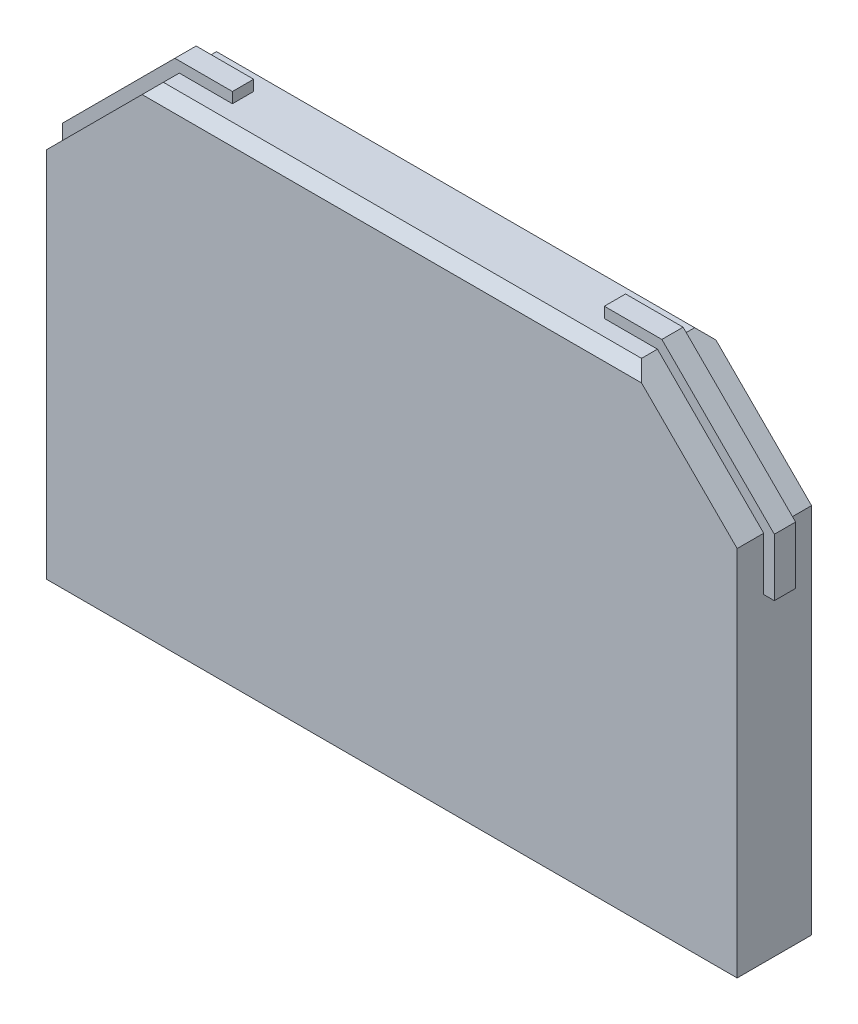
ISO-10303-21;
HEADER;
FILE_DESCRIPTION(('STEP AP214'),'2;1');
FILE_NAME('part.step','',(''),(''),'','','');
FILE_SCHEMA(('AUTOMOTIVE_DESIGN { 1 0 10303 214 1 1 1 1 }'));
ENDSEC;
DATA;
#1=APPLICATION_CONTEXT('core data for automotive mechanical design processes');
#2=APPLICATION_PROTOCOL_DEFINITION('international standard','automotive_design',2000,#1);
#3=PRODUCT_CONTEXT('',#1,'mechanical');
#4=PRODUCT('Part','Part','',(#3));
#5=PRODUCT_RELATED_PRODUCT_CATEGORY('part','',(#4));
#6=PRODUCT_DEFINITION_FORMATION('','',#4);
#7=PRODUCT_DEFINITION_CONTEXT('part definition',#1,'design');
#8=PRODUCT_DEFINITION('design','',#6,#7);
#9=PRODUCT_DEFINITION_SHAPE('','',#8);
#10=(LENGTH_UNIT() NAMED_UNIT(*) SI_UNIT(.MILLI.,.METRE.));
#11=(NAMED_UNIT(*) PLANE_ANGLE_UNIT() SI_UNIT($,.RADIAN.));
#12=(NAMED_UNIT(*) SI_UNIT($,.STERADIAN.) SOLID_ANGLE_UNIT());
#13=UNCERTAINTY_MEASURE_WITH_UNIT(LENGTH_MEASURE(1.E-05),#10,'distance_accuracy_value','');
#14=(GEOMETRIC_REPRESENTATION_CONTEXT(3) GLOBAL_UNCERTAINTY_ASSIGNED_CONTEXT((#13)) GLOBAL_UNIT_ASSIGNED_CONTEXT((#10,
#11,#12)) REPRESENTATION_CONTEXT('',''));
#15=CARTESIAN_POINT('',(0.,0.,0.));
#16=DIRECTION('',(0.,0.,1.));
#17=DIRECTION('',(1.,0.,0.));
#18=AXIS2_PLACEMENT_3D('',#15,#16,#17);
#19=CARTESIAN_POINT('',(-2.25,6.5,0.));
#20=DIRECTION('',(0.707106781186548,-0.707106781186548,0.));
#21=DIRECTION('',(0.,0.,1.));
#22=AXIS2_PLACEMENT_3D('',#19,#20,#21);
#23=PLANE('',#22);
#24=DIRECTION('',(0.,0.,-1.));
#25=VECTOR('',#24,1.);
#26=CARTESIAN_POINT('',(-3.25,5.5,0.35));
#27=LINE('',#26,#25);
#28=CARTESIAN_POINT('',(-3.25,5.5,-0.1));
#29=VERTEX_POINT('',#28);
#30=CARTESIAN_POINT('',(-3.25,5.5,-0.35));
#31=VERTEX_POINT('',#30);
#32=EDGE_CURVE('E11',#29,#31,#27,.T.);
#33=ORIENTED_EDGE('',*,*,#32,.F.);
#34=DIRECTION('',(-0.707106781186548,-0.707106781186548,0.));
#35=VECTOR('',#34,1.);
#36=CARTESIAN_POINT('',(-2.25,6.5,-0.1));
#37=LINE('',#36,#35);
#38=CARTESIAN_POINT('',(-2.25,6.5,-0.1));
#39=VERTEX_POINT('',#38);
#40=EDGE_CURVE('E25',#39,#29,#37,.T.);
#41=ORIENTED_EDGE('',*,*,#40,.F.);
#42=DIRECTION('',(0.,0.,1.));
#43=VECTOR('',#42,1.);
#44=CARTESIAN_POINT('',(-2.25,6.5,0.));
#45=LINE('',#44,#43);
#46=CARTESIAN_POINT('',(-2.25,6.5,-0.25));
#47=VERTEX_POINT('',#46);
#48=EDGE_CURVE('E460',#47,#39,#45,.T.);
#49=ORIENTED_EDGE('',*,*,#48,.F.);
#50=DIRECTION('',(-0.577350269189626,-0.577350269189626,-0.577350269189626));
#51=VECTOR('',#50,1.);
#52=CARTESIAN_POINT('',(-2.166666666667,6.583333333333,-0.166666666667));
#53=LINE('',#52,#51);
#54=CARTESIAN_POINT('',(-2.35,6.4,-0.35));
#55=VERTEX_POINT('',#54);
#56=EDGE_CURVE('E456',#47,#55,#53,.T.);
#57=ORIENTED_EDGE('',*,*,#56,.T.);
#58=DIRECTION('',(0.707106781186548,0.707106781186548,0.));
#59=VECTOR('',#58,1.);
#60=CARTESIAN_POINT('',(-2.25,6.5,-0.35));
#61=LINE('',#60,#59);
#62=EDGE_CURVE('E451',#31,#55,#61,.T.);
#63=ORIENTED_EDGE('',*,*,#62,.F.);
#64=EDGE_LOOP('',(#33,#41,#49,#57,#63));
#65=FACE_BOUND('',#64,.T.);
#66=ADVANCED_FACE('F17',(#65),#23,.F.);
#67=CARTESIAN_POINT('',(-3.25,6.5,-0.35));
#68=DIRECTION('',(0.,0.,1.));
#69=DIRECTION('',(1.,0.,0.));
#70=AXIS2_PLACEMENT_3D('',#67,#68,#69);
#71=PLANE('',#70);
#72=ORIENTED_EDGE('',*,*,#62,.T.);
#73=DIRECTION('',(1.,0.,0.));
#74=VECTOR('',#73,1.);
#75=CARTESIAN_POINT('',(-3.25,6.4,-0.35));
#76=LINE('',#75,#74);
#77=CARTESIAN_POINT('',(2.35,6.4,-0.35));
#78=VERTEX_POINT('',#77);
#79=EDGE_CURVE('E447',#55,#78,#76,.T.);
#80=ORIENTED_EDGE('',*,*,#79,.T.);
#81=DIRECTION('',(0.707106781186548,-0.707106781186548,0.));
#82=VECTOR('',#81,1.);
#83=CARTESIAN_POINT('',(2.25,6.5,-0.35));
#84=LINE('',#83,#82);
#85=CARTESIAN_POINT('',(3.25,5.5,-0.35));
#86=VERTEX_POINT('',#85);
#87=EDGE_CURVE('E443',#78,#86,#84,.T.);
#88=ORIENTED_EDGE('',*,*,#87,.T.);
#89=DIRECTION('',(0.,-1.,0.));
#90=VECTOR('',#89,1.);
#91=CARTESIAN_POINT('',(3.25,6.5,-0.35));
#92=LINE('',#91,#90);
#93=CARTESIAN_POINT('',(3.25,2.,-0.35));
#94=VERTEX_POINT('',#93);
#95=EDGE_CURVE('E439',#86,#94,#92,.T.);
#96=ORIENTED_EDGE('',*,*,#95,.T.);
#97=DIRECTION('',(-1.,0.,0.));
#98=VECTOR('',#97,1.);
#99=CARTESIAN_POINT('',(-3.25,2.,-0.35));
#100=LINE('',#99,#98);
#101=CARTESIAN_POINT('',(-3.25,2.,-0.35));
#102=VERTEX_POINT('',#101);
#103=EDGE_CURVE('E435',#94,#102,#100,.T.);
#104=ORIENTED_EDGE('',*,*,#103,.T.);
#105=DIRECTION('',(0.,-1.,0.));
#106=VECTOR('',#105,1.);
#107=CARTESIAN_POINT('',(-3.25,6.5,-0.35));
#108=LINE('',#107,#106);
#109=EDGE_CURVE('E430',#31,#102,#108,.T.);
#110=ORIENTED_EDGE('',*,*,#109,.F.);
#111=EDGE_LOOP('',(#72,#80,#88,#96,#104,#110));
#112=FACE_BOUND('',#111,.T.);
#113=ADVANCED_FACE('F486',(#112),#71,.F.);
#114=CARTESIAN_POINT('',(-3.25,6.5,0.35));
#115=DIRECTION('',(1.,0.,0.));
#116=DIRECTION('',(0.,0.,-1.));
#117=AXIS2_PLACEMENT_3D('',#114,#115,#116);
#118=PLANE('',#117);
#119=DIRECTION('',(0.,0.,-1.));
#120=VECTOR('',#119,1.);
#121=CARTESIAN_POINT('',(-3.25,5.5,0.35));
#122=LINE('',#121,#120);
#123=CARTESIAN_POINT('',(-3.25,5.5,0.35));
#124=VERTEX_POINT('',#123);
#125=CARTESIAN_POINT('',(-3.25,5.5,0.1));
#126=VERTEX_POINT('',#125);
#127=EDGE_CURVE('E426',#124,#126,#122,.T.);
#128=ORIENTED_EDGE('',*,*,#127,.T.);
#129=DIRECTION('',(0.,-1.,0.));
#130=VECTOR('',#129,1.);
#131=CARTESIAN_POINT('',(-3.25,5.5,0.1));
#132=LINE('',#131,#130);
#133=CARTESIAN_POINT('',(-3.25,5.,0.1));
#134=VERTEX_POINT('',#133);
#135=EDGE_CURVE('E422',#126,#134,#132,.T.);
#136=ORIENTED_EDGE('',*,*,#135,.T.);
#137=DIRECTION('',(0.,0.,-1.));
#138=VECTOR('',#137,1.);
#139=CARTESIAN_POINT('',(-3.25,5.,0.1));
#140=LINE('',#139,#138);
#141=CARTESIAN_POINT('',(-3.25,5.,-0.1));
#142=VERTEX_POINT('',#141);
#143=EDGE_CURVE('E418',#134,#142,#140,.T.);
#144=ORIENTED_EDGE('',*,*,#143,.T.);
#145=DIRECTION('',(0.,-1.,0.));
#146=VECTOR('',#145,1.);
#147=CARTESIAN_POINT('',(-3.25,5.5,-0.1));
#148=LINE('',#147,#146);
#149=EDGE_CURVE('E413',#29,#142,#148,.T.);
#150=ORIENTED_EDGE('',*,*,#149,.F.);
#151=ORIENTED_EDGE('',*,*,#32,.T.);
#152=ORIENTED_EDGE('',*,*,#109,.T.);
#153=DIRECTION('',(0.,0.,1.));
#154=VECTOR('',#153,1.);
#155=CARTESIAN_POINT('',(-3.25,2.,0.35));
#156=LINE('',#155,#154);
#157=CARTESIAN_POINT('',(-3.25,2.,0.35));
#158=VERTEX_POINT('',#157);
#159=EDGE_CURVE('E409',#102,#158,#156,.T.);
#160=ORIENTED_EDGE('',*,*,#159,.T.);
#161=DIRECTION('',(0.,-1.,0.));
#162=VECTOR('',#161,1.);
#163=CARTESIAN_POINT('',(-3.25,6.5,0.35));
#164=LINE('',#163,#162);
#165=EDGE_CURVE('E404',#124,#158,#164,.T.);
#166=ORIENTED_EDGE('',*,*,#165,.F.);
#167=EDGE_LOOP('',(#128,#136,#144,#150,#151,#152,#160,#166));
#168=FACE_BOUND('',#167,.T.);
#169=ADVANCED_FACE('F490',(#168),#118,.F.);
#170=CARTESIAN_POINT('',(-3.25,6.5,0.35));
#171=DIRECTION('',(0.,0.,-1.));
#172=DIRECTION('',(-1.,0.,0.));
#173=AXIS2_PLACEMENT_3D('',#170,#171,#172);
#174=PLANE('',#173);
#175=DIRECTION('',(-0.707106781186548,0.707106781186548,0.));
#176=VECTOR('',#175,1.);
#177=CARTESIAN_POINT('',(2.25,6.5,0.35));
#178=LINE('',#177,#176);
#179=CARTESIAN_POINT('',(3.25,5.5,0.35));
#180=VERTEX_POINT('',#179);
#181=CARTESIAN_POINT('',(2.35,6.4,0.35));
#182=VERTEX_POINT('',#181);
#183=EDGE_CURVE('E400',#180,#182,#178,.T.);
#184=ORIENTED_EDGE('',*,*,#183,.T.);
#185=DIRECTION('',(-1.,0.,0.));
#186=VECTOR('',#185,1.);
#187=CARTESIAN_POINT('',(-3.25,6.4,0.35));
#188=LINE('',#187,#186);
#189=CARTESIAN_POINT('',(-2.35,6.4,0.35));
#190=VERTEX_POINT('',#189);
#191=EDGE_CURVE('E396',#182,#190,#188,.T.);
#192=ORIENTED_EDGE('',*,*,#191,.T.);
#193=DIRECTION('',(-0.707106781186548,-0.707106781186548,0.));
#194=VECTOR('',#193,1.);
#195=CARTESIAN_POINT('',(-2.25,6.5,0.35));
#196=LINE('',#195,#194);
#197=EDGE_CURVE('E391',#190,#124,#196,.T.);
#198=ORIENTED_EDGE('',*,*,#197,.T.);
#199=ORIENTED_EDGE('',*,*,#165,.T.);
#200=DIRECTION('',(1.,0.,0.));
#201=VECTOR('',#200,1.);
#202=CARTESIAN_POINT('',(-3.25,2.,0.35));
#203=LINE('',#202,#201);
#204=CARTESIAN_POINT('',(3.25,2.,0.35));
#205=VERTEX_POINT('',#204);
#206=EDGE_CURVE('E387',#158,#205,#203,.T.);
#207=ORIENTED_EDGE('',*,*,#206,.T.);
#208=DIRECTION('',(0.,-1.,0.));
#209=VECTOR('',#208,1.);
#210=CARTESIAN_POINT('',(3.25,6.5,0.35));
#211=LINE('',#210,#209);
#212=EDGE_CURVE('E382',#180,#205,#211,.T.);
#213=ORIENTED_EDGE('',*,*,#212,.F.);
#214=EDGE_LOOP('',(#184,#192,#198,#199,#207,#213));
#215=FACE_BOUND('',#214,.T.);
#216=ADVANCED_FACE('F590',(#215),#174,.F.);
#217=CARTESIAN_POINT('',(3.25,6.5,0.35));
#218=DIRECTION('',(-1.,0.,0.));
#219=DIRECTION('',(0.,0.,1.));
#220=AXIS2_PLACEMENT_3D('',#217,#218,#219);
#221=PLANE('',#220);
#222=DIRECTION('',(0.,0.,-1.));
#223=VECTOR('',#222,1.);
#224=CARTESIAN_POINT('',(3.25,5.,0.1));
#225=LINE('',#224,#223);
#226=CARTESIAN_POINT('',(3.25,5.,0.1));
#227=VERTEX_POINT('',#226);
#228=CARTESIAN_POINT('',(3.25,5.,-0.1));
#229=VERTEX_POINT('',#228);
#230=EDGE_CURVE('E377',#227,#229,#225,.T.);
#231=ORIENTED_EDGE('',*,*,#230,.F.);
#232=DIRECTION('',(0.,-1.,0.));
#233=VECTOR('',#232,1.);
#234=CARTESIAN_POINT('',(3.25,5.5,0.1));
#235=LINE('',#234,#233);
#236=CARTESIAN_POINT('',(3.25,5.5,0.1));
#237=VERTEX_POINT('',#236);
#238=EDGE_CURVE('E372',#237,#227,#235,.T.);
#239=ORIENTED_EDGE('',*,*,#238,.F.);
#240=DIRECTION('',(0.,0.,1.));
#241=VECTOR('',#240,1.);
#242=CARTESIAN_POINT('',(3.25,5.5,0.35));
#243=LINE('',#242,#241);
#244=EDGE_CURVE('E367',#237,#180,#243,.T.);
#245=ORIENTED_EDGE('',*,*,#244,.T.);
#246=ORIENTED_EDGE('',*,*,#212,.T.);
#247=DIRECTION('',(0.,0.,-1.));
#248=VECTOR('',#247,1.);
#249=CARTESIAN_POINT('',(3.25,2.,0.35));
#250=LINE('',#249,#248);
#251=EDGE_CURVE('E362',#205,#94,#250,.T.);
#252=ORIENTED_EDGE('',*,*,#251,.T.);
#253=ORIENTED_EDGE('',*,*,#95,.F.);
#254=DIRECTION('',(0.,0.,1.));
#255=VECTOR('',#254,1.);
#256=CARTESIAN_POINT('',(3.25,5.5,0.35));
#257=LINE('',#256,#255);
#258=CARTESIAN_POINT('',(3.25,5.5,-0.1));
#259=VERTEX_POINT('',#258);
#260=EDGE_CURVE('E358',#86,#259,#257,.T.);
#261=ORIENTED_EDGE('',*,*,#260,.T.);
#262=DIRECTION('',(0.,-1.,0.));
#263=VECTOR('',#262,1.);
#264=CARTESIAN_POINT('',(3.25,5.5,-0.1));
#265=LINE('',#264,#263);
#266=EDGE_CURVE('E354',#259,#229,#265,.T.);
#267=ORIENTED_EDGE('',*,*,#266,.T.);
#268=EDGE_LOOP('',(#231,#239,#245,#246,#252,#253,#261,#267));
#269=FACE_BOUND('',#268,.T.);
#270=ADVANCED_FACE('F585',(#269),#221,.F.);
#271=CARTESIAN_POINT('',(0.,0.,-0.1));
#272=DIRECTION('',(0.,0.,1.));
#273=DIRECTION('',(1.,0.,0.));
#274=AXIS2_PLACEMENT_3D('',#271,#272,#273);
#275=PLANE('',#274);
#276=DIRECTION('',(0.,-1.,0.));
#277=VECTOR('',#276,1.);
#278=CARTESIAN_POINT('',(1.75,6.5,-0.1));
#279=LINE('',#278,#277);
#280=CARTESIAN_POINT('',(1.75,6.6,-0.1));
#281=VERTEX_POINT('',#280);
#282=CARTESIAN_POINT('',(1.75,6.5,-0.1));
#283=VERTEX_POINT('',#282);
#284=EDGE_CURVE('E350',#281,#283,#279,.T.);
#285=ORIENTED_EDGE('',*,*,#284,.F.);
#286=DIRECTION('',(-1.,0.,0.));
#287=VECTOR('',#286,1.);
#288=CARTESIAN_POINT('',(2.291421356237,6.6,-0.1));
#289=LINE('',#288,#287);
#290=CARTESIAN_POINT('',(2.291421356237,6.6,-0.1));
#291=VERTEX_POINT('',#290);
#292=EDGE_CURVE('E191',#291,#281,#289,.T.);
#293=ORIENTED_EDGE('',*,*,#292,.F.);
#294=DIRECTION('',(-0.707106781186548,0.707106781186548,0.));
#295=VECTOR('',#294,1.);
#296=CARTESIAN_POINT('',(2.291421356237,6.6,-0.1));
#297=LINE('',#296,#295);
#298=CARTESIAN_POINT('',(3.35,5.541421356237,-0.1));
#299=VERTEX_POINT('',#298);
#300=EDGE_CURVE('E342',#299,#291,#297,.T.);
#301=ORIENTED_EDGE('',*,*,#300,.F.);
#302=DIRECTION('',(0.,1.,0.));
#303=VECTOR('',#302,1.);
#304=CARTESIAN_POINT('',(3.35,5.541421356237,-0.1));
#305=LINE('',#304,#303);
#306=CARTESIAN_POINT('',(3.35,5.,-0.1));
#307=VERTEX_POINT('',#306);
#308=EDGE_CURVE('E337',#307,#299,#305,.T.);
#309=ORIENTED_EDGE('',*,*,#308,.F.);
#310=DIRECTION('',(1.,0.,0.));
#311=VECTOR('',#310,1.);
#312=CARTESIAN_POINT('',(3.25,5.,-0.1));
#313=LINE('',#312,#311);
#314=EDGE_CURVE('E332',#229,#307,#313,.T.);
#315=ORIENTED_EDGE('',*,*,#314,.F.);
#316=ORIENTED_EDGE('',*,*,#266,.F.);
#317=DIRECTION('',(0.707106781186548,-0.707106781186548,0.));
#318=VECTOR('',#317,1.);
#319=CARTESIAN_POINT('',(2.25,6.5,-0.1));
#320=LINE('',#319,#318);
#321=CARTESIAN_POINT('',(2.25,6.5,-0.1));
#322=VERTEX_POINT('',#321);
#323=EDGE_CURVE('E327',#322,#259,#320,.T.);
#324=ORIENTED_EDGE('',*,*,#323,.F.);
#325=DIRECTION('',(1.,0.,0.));
#326=VECTOR('',#325,1.);
#327=CARTESIAN_POINT('',(2.25,6.5,-0.1));
#328=LINE('',#327,#326);
#329=EDGE_CURVE('E322',#283,#322,#328,.T.);
#330=ORIENTED_EDGE('',*,*,#329,.F.);
#331=EDGE_LOOP('',(#285,#293,#301,#309,#315,#316,#324,#330));
#332=FACE_BOUND('',#331,.T.);
#333=ADVANCED_FACE('F598',(#332),#275,.F.);
#334=CARTESIAN_POINT('',(0.,6.5,0.));
#335=DIRECTION('',(0.,-1.,0.));
#336=DIRECTION('',(0.,0.,-1.));
#337=AXIS2_PLACEMENT_3D('',#334,#335,#336);
#338=PLANE('',#337);
#339=DIRECTION('',(0.,0.,-1.));
#340=VECTOR('',#339,1.);
#341=CARTESIAN_POINT('',(-1.75,6.5,0.1));
#342=LINE('',#341,#340);
#343=CARTESIAN_POINT('',(-1.75,6.5,0.1));
#344=VERTEX_POINT('',#343);
#345=CARTESIAN_POINT('',(-1.75,6.5,-0.1));
#346=VERTEX_POINT('',#345);
#347=EDGE_CURVE('E317',#344,#346,#342,.T.);
#348=ORIENTED_EDGE('',*,*,#347,.F.);
#349=DIRECTION('',(-1.,0.,0.));
#350=VECTOR('',#349,1.);
#351=CARTESIAN_POINT('',(-2.25,6.5,0.1));
#352=LINE('',#351,#350);
#353=CARTESIAN_POINT('',(-2.25,6.5,0.1));
#354=VERTEX_POINT('',#353);
#355=EDGE_CURVE('E313',#344,#354,#352,.T.);
#356=ORIENTED_EDGE('',*,*,#355,.T.);
#357=DIRECTION('',(0.,0.,1.));
#358=VECTOR('',#357,1.);
#359=CARTESIAN_POINT('',(-2.25,6.5,0.));
#360=LINE('',#359,#358);
#361=CARTESIAN_POINT('',(-2.25,6.5,0.25));
#362=VERTEX_POINT('',#361);
#363=EDGE_CURVE('E309',#354,#362,#360,.T.);
#364=ORIENTED_EDGE('',*,*,#363,.T.);
#365=DIRECTION('',(1.,0.,0.));
#366=VECTOR('',#365,1.);
#367=CARTESIAN_POINT('',(0.,6.5,0.25));
#368=LINE('',#367,#366);
#369=CARTESIAN_POINT('',(2.25,6.5,0.25));
#370=VERTEX_POINT('',#369);
#371=EDGE_CURVE('E305',#362,#370,#368,.T.);
#372=ORIENTED_EDGE('',*,*,#371,.T.);
#373=DIRECTION('',(0.,0.,-1.));
#374=VECTOR('',#373,1.);
#375=CARTESIAN_POINT('',(2.25,6.5,0.));
#376=LINE('',#375,#374);
#377=CARTESIAN_POINT('',(2.25,6.5,0.1));
#378=VERTEX_POINT('',#377);
#379=EDGE_CURVE('E301',#370,#378,#376,.T.);
#380=ORIENTED_EDGE('',*,*,#379,.T.);
#381=DIRECTION('',(1.,0.,0.));
#382=VECTOR('',#381,1.);
#383=CARTESIAN_POINT('',(2.25,6.5,0.1));
#384=LINE('',#383,#382);
#385=CARTESIAN_POINT('',(1.75,6.5,0.1));
#386=VERTEX_POINT('',#385);
#387=EDGE_CURVE('E297',#386,#378,#384,.T.);
#388=ORIENTED_EDGE('',*,*,#387,.F.);
#389=DIRECTION('',(0.,0.,-1.));
#390=VECTOR('',#389,1.);
#391=CARTESIAN_POINT('',(1.75,6.5,0.1));
#392=LINE('',#391,#390);
#393=EDGE_CURVE('E198',#386,#283,#392,.T.);
#394=ORIENTED_EDGE('',*,*,#393,.T.);
#395=ORIENTED_EDGE('',*,*,#329,.T.);
#396=DIRECTION('',(0.,0.,-1.));
#397=VECTOR('',#396,1.);
#398=CARTESIAN_POINT('',(2.25,6.5,0.));
#399=LINE('',#398,#397);
#400=CARTESIAN_POINT('',(2.25,6.5,-0.25));
#401=VERTEX_POINT('',#400);
#402=EDGE_CURVE('E290',#322,#401,#399,.T.);
#403=ORIENTED_EDGE('',*,*,#402,.T.);
#404=DIRECTION('',(-1.,0.,0.));
#405=VECTOR('',#404,1.);
#406=CARTESIAN_POINT('',(0.,6.5,-0.25));
#407=LINE('',#406,#405);
#408=EDGE_CURVE('E285',#401,#47,#407,.T.);
#409=ORIENTED_EDGE('',*,*,#408,.T.);
#410=ORIENTED_EDGE('',*,*,#48,.T.);
#411=DIRECTION('',(-1.,0.,0.));
#412=VECTOR('',#411,1.);
#413=CARTESIAN_POINT('',(-2.25,6.5,-0.1));
#414=LINE('',#413,#412);
#415=EDGE_CURVE('E281',#346,#39,#414,.T.);
#416=ORIENTED_EDGE('',*,*,#415,.F.);
#417=EDGE_LOOP('',(#348,#356,#364,#372,#380,#388,#394,#395,#403,#409,#410,#416));
#418=FACE_BOUND('',#417,.T.);
#419=ADVANCED_FACE('F474',(#418),#338,.F.);
#420=CARTESIAN_POINT('',(0.,0.,-0.1));
#421=DIRECTION('',(0.,0.,1.));
#422=DIRECTION('',(-1.,0.,0.));
#423=AXIS2_PLACEMENT_3D('',#420,#421,#422);
#424=PLANE('',#423);
#425=DIRECTION('',(0.,-1.,0.));
#426=VECTOR('',#425,1.);
#427=CARTESIAN_POINT('',(-1.75,6.5,-0.1));
#428=LINE('',#427,#426);
#429=CARTESIAN_POINT('',(-1.75,6.6,-0.1));
#430=VERTEX_POINT('',#429);
#431=EDGE_CURVE('E276',#430,#346,#428,.T.);
#432=ORIENTED_EDGE('',*,*,#431,.T.);
#433=ORIENTED_EDGE('',*,*,#415,.T.);
#434=ORIENTED_EDGE('',*,*,#40,.T.);
#435=ORIENTED_EDGE('',*,*,#149,.T.);
#436=DIRECTION('',(-1.,0.,0.));
#437=VECTOR('',#436,1.);
#438=CARTESIAN_POINT('',(-3.25,5.,-0.1));
#439=LINE('',#438,#437);
#440=CARTESIAN_POINT('',(-3.35,5.,-0.1));
#441=VERTEX_POINT('',#440);
#442=EDGE_CURVE('E272',#142,#441,#439,.T.);
#443=ORIENTED_EDGE('',*,*,#442,.T.);
#444=DIRECTION('',(0.,1.,0.));
#445=VECTOR('',#444,1.);
#446=CARTESIAN_POINT('',(-3.35,5.541421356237,-0.1));
#447=LINE('',#446,#445);
#448=CARTESIAN_POINT('',(-3.35,5.541421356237,-0.1));
#449=VERTEX_POINT('',#448);
#450=EDGE_CURVE('E268',#441,#449,#447,.T.);
#451=ORIENTED_EDGE('',*,*,#450,.T.);
#452=DIRECTION('',(0.707106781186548,0.707106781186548,0.));
#453=VECTOR('',#452,1.);
#454=CARTESIAN_POINT('',(-2.291421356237,6.6,-0.1));
#455=LINE('',#454,#453);
#456=CARTESIAN_POINT('',(-2.291421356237,6.6,-0.1));
#457=VERTEX_POINT('',#456);
#458=EDGE_CURVE('E264',#449,#457,#455,.T.);
#459=ORIENTED_EDGE('',*,*,#458,.T.);
#460=DIRECTION('',(1.,0.,0.));
#461=VECTOR('',#460,1.);
#462=CARTESIAN_POINT('',(-2.291421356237,6.6,-0.1));
#463=LINE('',#462,#461);
#464=EDGE_CURVE('E260',#457,#430,#463,.T.);
#465=ORIENTED_EDGE('',*,*,#464,.T.);
#466=EDGE_LOOP('',(#432,#433,#434,#435,#443,#451,#459,#465));
#467=FACE_BOUND('',#466,.T.);
#468=ADVANCED_FACE('F470',(#467),#424,.F.);
#469=CARTESIAN_POINT('',(-2.291421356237,6.6,0.1));
#470=DIRECTION('',(0.,1.,0.));
#471=DIRECTION('',(0.,0.,1.));
#472=AXIS2_PLACEMENT_3D('',#469,#470,#471);
#473=PLANE('',#472);
#474=ORIENTED_EDGE('',*,*,#464,.F.);
#475=DIRECTION('',(0.,0.,-1.));
#476=VECTOR('',#475,1.);
#477=CARTESIAN_POINT('',(-2.291421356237,6.6,0.1));
#478=LINE('',#477,#476);
#479=CARTESIAN_POINT('',(-2.291421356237,6.6,0.1));
#480=VERTEX_POINT('',#479);
#481=EDGE_CURVE('E255',#480,#457,#478,.T.);
#482=ORIENTED_EDGE('',*,*,#481,.F.);
#483=DIRECTION('',(1.,0.,0.));
#484=VECTOR('',#483,1.);
#485=CARTESIAN_POINT('',(-2.291421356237,6.6,0.1));
#486=LINE('',#485,#484);
#487=CARTESIAN_POINT('',(-1.75,6.6,0.1));
#488=VERTEX_POINT('',#487);
#489=EDGE_CURVE('E251',#480,#488,#486,.T.);
#490=ORIENTED_EDGE('',*,*,#489,.T.);
#491=DIRECTION('',(0.,0.,-1.));
#492=VECTOR('',#491,1.);
#493=CARTESIAN_POINT('',(-1.75,6.6,0.1));
#494=LINE('',#493,#492);
#495=EDGE_CURVE('E246',#488,#430,#494,.T.);
#496=ORIENTED_EDGE('',*,*,#495,.T.);
#497=EDGE_LOOP('',(#474,#482,#490,#496));
#498=FACE_BOUND('',#497,.T.);
#499=ADVANCED_FACE('F512',(#498),#473,.T.);
#500=CARTESIAN_POINT('',(-1.75,6.5,0.1));
#501=DIRECTION('',(1.,0.,0.));
#502=DIRECTION('',(0.,0.,-1.));
#503=AXIS2_PLACEMENT_3D('',#500,#501,#502);
#504=PLANE('',#503);
#505=ORIENTED_EDGE('',*,*,#431,.F.);
#506=ORIENTED_EDGE('',*,*,#495,.F.);
#507=DIRECTION('',(0.,-1.,0.));
#508=VECTOR('',#507,1.);
#509=CARTESIAN_POINT('',(-1.75,6.5,0.1));
#510=LINE('',#509,#508);
#511=EDGE_CURVE('E241',#488,#344,#510,.T.);
#512=ORIENTED_EDGE('',*,*,#511,.T.);
#513=ORIENTED_EDGE('',*,*,#347,.T.);
#514=EDGE_LOOP('',(#505,#506,#512,#513));
#515=FACE_BOUND('',#514,.T.);
#516=ADVANCED_FACE('F516',(#515),#504,.T.);
#517=CARTESIAN_POINT('',(0.,0.,0.1));
#518=DIRECTION('',(0.,0.,1.));
#519=DIRECTION('',(-1.,0.,0.));
#520=AXIS2_PLACEMENT_3D('',#517,#518,#519);
#521=PLANE('',#520);
#522=ORIENTED_EDGE('',*,*,#511,.F.);
#523=ORIENTED_EDGE('',*,*,#489,.F.);
#524=DIRECTION('',(0.707106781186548,0.707106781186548,0.));
#525=VECTOR('',#524,1.);
#526=CARTESIAN_POINT('',(-2.291421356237,6.6,0.1));
#527=LINE('',#526,#525);
#528=CARTESIAN_POINT('',(-3.35,5.541421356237,0.1));
#529=VERTEX_POINT('',#528);
#530=EDGE_CURVE('E236',#529,#480,#527,.T.);
#531=ORIENTED_EDGE('',*,*,#530,.F.);
#532=DIRECTION('',(0.,1.,0.));
#533=VECTOR('',#532,1.);
#534=CARTESIAN_POINT('',(-3.35,5.541421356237,0.1));
#535=LINE('',#534,#533);
#536=CARTESIAN_POINT('',(-3.35,5.,0.1));
#537=VERTEX_POINT('',#536);
#538=EDGE_CURVE('E231',#537,#529,#535,.T.);
#539=ORIENTED_EDGE('',*,*,#538,.F.);
#540=DIRECTION('',(-1.,0.,0.));
#541=VECTOR('',#540,1.);
#542=CARTESIAN_POINT('',(-3.25,5.,0.1));
#543=LINE('',#542,#541);
#544=EDGE_CURVE('E226',#134,#537,#543,.T.);
#545=ORIENTED_EDGE('',*,*,#544,.F.);
#546=ORIENTED_EDGE('',*,*,#135,.F.);
#547=DIRECTION('',(-0.707106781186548,-0.707106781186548,0.));
#548=VECTOR('',#547,1.);
#549=CARTESIAN_POINT('',(-2.25,6.5,0.1));
#550=LINE('',#549,#548);
#551=EDGE_CURVE('E221',#354,#126,#550,.T.);
#552=ORIENTED_EDGE('',*,*,#551,.F.);
#553=ORIENTED_EDGE('',*,*,#355,.F.);
#554=EDGE_LOOP('',(#522,#523,#531,#539,#545,#546,#552,#553));
#555=FACE_BOUND('',#554,.T.);
#556=ADVANCED_FACE('F521',(#555),#521,.T.);
#557=CARTESIAN_POINT('',(-2.25,6.5,0.));
#558=DIRECTION('',(0.707106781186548,-0.707106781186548,0.));
#559=DIRECTION('',(0.,0.,1.));
#560=AXIS2_PLACEMENT_3D('',#557,#558,#559);
#561=PLANE('',#560);
#562=ORIENTED_EDGE('',*,*,#551,.T.);
#563=ORIENTED_EDGE('',*,*,#127,.F.);
#564=ORIENTED_EDGE('',*,*,#197,.F.);
#565=DIRECTION('',(0.577350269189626,0.577350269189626,-0.577350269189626));
#566=VECTOR('',#565,1.);
#567=CARTESIAN_POINT('',(-2.166666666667,6.583333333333,0.166666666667));
#568=LINE('',#567,#566);
#569=EDGE_CURVE('E216',#190,#362,#568,.T.);
#570=ORIENTED_EDGE('',*,*,#569,.T.);
#571=ORIENTED_EDGE('',*,*,#363,.F.);
#572=EDGE_LOOP('',(#562,#563,#564,#570,#571));
#573=FACE_BOUND('',#572,.T.);
#574=ADVANCED_FACE('F524',(#573),#561,.F.);
#575=CARTESIAN_POINT('',(0.,6.5,0.25));
#576=DIRECTION('',(0.,-0.707106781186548,-0.707106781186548));
#577=DIRECTION('',(1.,0.,0.));
#578=AXIS2_PLACEMENT_3D('',#575,#576,#577);
#579=PLANE('',#578);
#580=ORIENTED_EDGE('',*,*,#569,.F.);
#581=ORIENTED_EDGE('',*,*,#191,.F.);
#582=DIRECTION('',(0.577350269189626,-0.577350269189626,0.577350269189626));
#583=VECTOR('',#582,1.);
#584=CARTESIAN_POINT('',(2.166666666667,6.583333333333,0.166666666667));
#585=LINE('',#584,#583);
#586=EDGE_CURVE('E203',#370,#182,#585,.T.);
#587=ORIENTED_EDGE('',*,*,#586,.F.);
#588=ORIENTED_EDGE('',*,*,#371,.F.);
#589=EDGE_LOOP('',(#580,#581,#587,#588));
#590=FACE_BOUND('',#589,.T.);
#591=ADVANCED_FACE('F531',(#590),#579,.F.);
#592=CARTESIAN_POINT('',(2.25,6.5,0.));
#593=DIRECTION('',(-0.707106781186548,-0.707106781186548,0.));
#594=DIRECTION('',(0.,0.,-1.));
#595=AXIS2_PLACEMENT_3D('',#592,#593,#594);
#596=PLANE('',#595);
#597=DIRECTION('',(0.707106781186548,-0.707106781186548,0.));
#598=VECTOR('',#597,1.);
#599=CARTESIAN_POINT('',(2.25,6.5,0.1));
#600=LINE('',#599,#598);
#601=EDGE_CURVE('E199',#378,#237,#600,.T.);
#602=ORIENTED_EDGE('',*,*,#601,.F.);
#603=ORIENTED_EDGE('',*,*,#379,.F.);
#604=ORIENTED_EDGE('',*,*,#586,.T.);
#605=ORIENTED_EDGE('',*,*,#183,.F.);
#606=ORIENTED_EDGE('',*,*,#244,.F.);
#607=EDGE_LOOP('',(#602,#603,#604,#605,#606));
#608=FACE_BOUND('',#607,.T.);
#609=ADVANCED_FACE('F536',(#608),#596,.F.);
#610=CARTESIAN_POINT('',(0.,0.,0.1));
#611=DIRECTION('',(0.,0.,1.));
#612=DIRECTION('',(1.,0.,0.));
#613=AXIS2_PLACEMENT_3D('',#610,#611,#612);
#614=PLANE('',#613);
#615=DIRECTION('',(0.,-1.,0.));
#616=VECTOR('',#615,1.);
#617=CARTESIAN_POINT('',(1.75,6.5,0.1));
#618=LINE('',#617,#616);
#619=CARTESIAN_POINT('',(1.75,6.6,0.1));
#620=VERTEX_POINT('',#619);
#621=EDGE_CURVE('E179',#620,#386,#618,.T.);
#622=ORIENTED_EDGE('',*,*,#621,.T.);
#623=ORIENTED_EDGE('',*,*,#387,.T.);
#624=ORIENTED_EDGE('',*,*,#601,.T.);
#625=ORIENTED_EDGE('',*,*,#238,.T.);
#626=DIRECTION('',(1.,0.,0.));
#627=VECTOR('',#626,1.);
#628=CARTESIAN_POINT('',(3.25,5.,0.1));
#629=LINE('',#628,#627);
#630=CARTESIAN_POINT('',(3.35,5.,0.1));
#631=VERTEX_POINT('',#630);
#632=EDGE_CURVE('E200',#227,#631,#629,.T.);
#633=ORIENTED_EDGE('',*,*,#632,.T.);
#634=DIRECTION('',(0.,1.,0.));
#635=VECTOR('',#634,1.);
#636=CARTESIAN_POINT('',(3.35,5.541421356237,0.1));
#637=LINE('',#636,#635);
#638=CARTESIAN_POINT('',(3.35,5.541421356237,0.1));
#639=VERTEX_POINT('',#638);
#640=EDGE_CURVE('E205',#631,#639,#637,.T.);
#641=ORIENTED_EDGE('',*,*,#640,.T.);
#642=DIRECTION('',(-0.707106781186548,0.707106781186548,0.));
#643=VECTOR('',#642,1.);
#644=CARTESIAN_POINT('',(2.291421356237,6.6,0.1));
#645=LINE('',#644,#643);
#646=CARTESIAN_POINT('',(2.291421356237,6.6,0.1));
#647=VERTEX_POINT('',#646);
#648=EDGE_CURVE('E182',#639,#647,#645,.T.);
#649=ORIENTED_EDGE('',*,*,#648,.T.);
#650=DIRECTION('',(-1.,0.,0.));
#651=VECTOR('',#650,1.);
#652=CARTESIAN_POINT('',(2.291421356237,6.6,0.1));
#653=LINE('',#652,#651);
#654=EDGE_CURVE('E174',#647,#620,#653,.T.);
#655=ORIENTED_EDGE('',*,*,#654,.T.);
#656=EDGE_LOOP('',(#622,#623,#624,#625,#633,#641,#649,#655));
#657=FACE_BOUND('',#656,.T.);
#658=ADVANCED_FACE('F176',(#657),#614,.T.);
#659=CARTESIAN_POINT('',(2.291421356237,6.6,0.1));
#660=DIRECTION('',(0.,-1.,0.));
#661=DIRECTION('',(0.,0.,-1.));
#662=AXIS2_PLACEMENT_3D('',#659,#660,#661);
#663=PLANE('',#662);
#664=ORIENTED_EDGE('',*,*,#292,.T.);
#665=DIRECTION('',(0.,0.,-1.));
#666=VECTOR('',#665,1.);
#667=CARTESIAN_POINT('',(1.75,6.6,0.1));
#668=LINE('',#667,#666);
#669=EDGE_CURVE('E186',#620,#281,#668,.T.);
#670=ORIENTED_EDGE('',*,*,#669,.F.);
#671=ORIENTED_EDGE('',*,*,#654,.F.);
#672=DIRECTION('',(0.,0.,-1.));
#673=VECTOR('',#672,1.);
#674=CARTESIAN_POINT('',(2.291421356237,6.6,0.1));
#675=LINE('',#674,#673);
#676=EDGE_CURVE('E194',#647,#291,#675,.T.);
#677=ORIENTED_EDGE('',*,*,#676,.T.);
#678=EDGE_LOOP('',(#664,#670,#671,#677));
#679=FACE_BOUND('',#678,.T.);
#680=ADVANCED_FACE('F190',(#679),#663,.F.);
#681=CARTESIAN_POINT('',(2.291421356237,6.6,0.1));
#682=DIRECTION('',(-0.707106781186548,-0.707106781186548,0.));
#683=DIRECTION('',(0.707106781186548,-0.707106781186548,0.));
#684=AXIS2_PLACEMENT_3D('',#681,#682,#683);
#685=PLANE('',#684);
#686=ORIENTED_EDGE('',*,*,#300,.T.);
#687=ORIENTED_EDGE('',*,*,#676,.F.);
#688=ORIENTED_EDGE('',*,*,#648,.F.);
#689=DIRECTION('',(0.,0.,-1.));
#690=VECTOR('',#689,1.);
#691=CARTESIAN_POINT('',(3.35,5.541421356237,0.1));
#692=LINE('',#691,#690);
#693=EDGE_CURVE('E548',#639,#299,#692,.T.);
#694=ORIENTED_EDGE('',*,*,#693,.T.);
#695=EDGE_LOOP('',(#686,#687,#688,#694));
#696=FACE_BOUND('',#695,.T.);
#697=ADVANCED_FACE('F729',(#696),#685,.F.);
#698=CARTESIAN_POINT('',(3.35,5.541421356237,0.1));
#699=DIRECTION('',(-1.,0.,0.));
#700=DIRECTION('',(0.,0.,1.));
#701=AXIS2_PLACEMENT_3D('',#698,#699,#700);
#702=PLANE('',#701);
#703=ORIENTED_EDGE('',*,*,#308,.T.);
#704=ORIENTED_EDGE('',*,*,#693,.F.);
#705=ORIENTED_EDGE('',*,*,#640,.F.);
#706=DIRECTION('',(0.,0.,-1.));
#707=VECTOR('',#706,1.);
#708=CARTESIAN_POINT('',(3.35,5.,0.1));
#709=LINE('',#708,#707);
#710=EDGE_CURVE('E544',#631,#307,#709,.T.);
#711=ORIENTED_EDGE('',*,*,#710,.T.);
#712=EDGE_LOOP('',(#703,#704,#705,#711));
#713=FACE_BOUND('',#712,.T.);
#714=ADVANCED_FACE('F551',(#713),#702,.F.);
#715=CARTESIAN_POINT('',(3.25,5.,0.1));
#716=DIRECTION('',(0.,1.,0.));
#717=DIRECTION('',(0.,0.,1.));
#718=AXIS2_PLACEMENT_3D('',#715,#716,#717);
#719=PLANE('',#718);
#720=ORIENTED_EDGE('',*,*,#314,.T.);
#721=ORIENTED_EDGE('',*,*,#710,.F.);
#722=ORIENTED_EDGE('',*,*,#632,.F.);
#723=ORIENTED_EDGE('',*,*,#230,.T.);
#724=EDGE_LOOP('',(#720,#721,#722,#723));
#725=FACE_BOUND('',#724,.T.);
#726=ADVANCED_FACE('F542',(#725),#719,.F.);
#727=CARTESIAN_POINT('',(1.75,6.5,0.1));
#728=DIRECTION('',(1.,0.,0.));
#729=DIRECTION('',(0.,0.,-1.));
#730=AXIS2_PLACEMENT_3D('',#727,#728,#729);
#731=PLANE('',#730);
#732=ORIENTED_EDGE('',*,*,#284,.T.);
#733=ORIENTED_EDGE('',*,*,#393,.F.);
#734=ORIENTED_EDGE('',*,*,#621,.F.);
#735=ORIENTED_EDGE('',*,*,#669,.T.);
#736=EDGE_LOOP('',(#732,#733,#734,#735));
#737=FACE_BOUND('',#736,.T.);
#738=ADVANCED_FACE('F196',(#737),#731,.F.);
#739=CARTESIAN_POINT('',(-3.25,5.,0.1));
#740=DIRECTION('',(0.,-1.,0.));
#741=DIRECTION('',(0.,0.,-1.));
#742=AXIS2_PLACEMENT_3D('',#739,#740,#741);
#743=PLANE('',#742);
#744=ORIENTED_EDGE('',*,*,#442,.F.);
#745=ORIENTED_EDGE('',*,*,#143,.F.);
#746=ORIENTED_EDGE('',*,*,#544,.T.);
#747=DIRECTION('',(0.,0.,-1.));
#748=VECTOR('',#747,1.);
#749=CARTESIAN_POINT('',(-3.35,5.,0.1));
#750=LINE('',#749,#748);
#751=EDGE_CURVE('E498',#537,#441,#750,.T.);
#752=ORIENTED_EDGE('',*,*,#751,.T.);
#753=EDGE_LOOP('',(#744,#745,#746,#752));
#754=FACE_BOUND('',#753,.T.);
#755=ADVANCED_FACE('F495',(#754),#743,.T.);
#756=CARTESIAN_POINT('',(-3.35,5.541421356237,0.1));
#757=DIRECTION('',(-1.,0.,0.));
#758=DIRECTION('',(0.,0.,1.));
#759=AXIS2_PLACEMENT_3D('',#756,#757,#758);
#760=PLANE('',#759);
#761=ORIENTED_EDGE('',*,*,#450,.F.);
#762=ORIENTED_EDGE('',*,*,#751,.F.);
#763=ORIENTED_EDGE('',*,*,#538,.T.);
#764=DIRECTION('',(0.,0.,-1.));
#765=VECTOR('',#764,1.);
#766=CARTESIAN_POINT('',(-3.35,5.541421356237,0.1));
#767=LINE('',#766,#765);
#768=EDGE_CURVE('E504',#529,#449,#767,.T.);
#769=ORIENTED_EDGE('',*,*,#768,.T.);
#770=EDGE_LOOP('',(#761,#762,#763,#769));
#771=FACE_BOUND('',#770,.T.);
#772=ADVANCED_FACE('F505',(#771),#760,.T.);
#773=CARTESIAN_POINT('',(-2.291421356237,6.6,0.1));
#774=DIRECTION('',(-0.707106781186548,0.707106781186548,0.));
#775=DIRECTION('',(-0.707106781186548,-0.707106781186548,0.));
#776=AXIS2_PLACEMENT_3D('',#773,#774,#775);
#777=PLANE('',#776);
#778=ORIENTED_EDGE('',*,*,#458,.F.);
#779=ORIENTED_EDGE('',*,*,#768,.F.);
#780=ORIENTED_EDGE('',*,*,#530,.T.);
#781=ORIENTED_EDGE('',*,*,#481,.T.);
#782=EDGE_LOOP('',(#778,#779,#780,#781));
#783=FACE_BOUND('',#782,.T.);
#784=ADVANCED_FACE('F508',(#783),#777,.T.);
#785=CARTESIAN_POINT('',(0.,6.5,-0.25));
#786=DIRECTION('',(0.,-0.707106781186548,0.707106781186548));
#787=DIRECTION('',(-1.,0.,0.));
#788=AXIS2_PLACEMENT_3D('',#785,#786,#787);
#789=PLANE('',#788);
#790=DIRECTION('',(-0.577350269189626,0.577350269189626,0.577350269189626));
#791=VECTOR('',#790,1.);
#792=CARTESIAN_POINT('',(2.166666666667,6.583333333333,-0.166666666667));
#793=LINE('',#792,#791);
#794=EDGE_CURVE('E483',#78,#401,#793,.T.);
#795=ORIENTED_EDGE('',*,*,#794,.F.);
#796=ORIENTED_EDGE('',*,*,#79,.F.);
#797=ORIENTED_EDGE('',*,*,#56,.F.);
#798=ORIENTED_EDGE('',*,*,#408,.F.);
#799=EDGE_LOOP('',(#795,#796,#797,#798));
#800=FACE_BOUND('',#799,.T.);
#801=ADVANCED_FACE('F481',(#800),#789,.F.);
#802=CARTESIAN_POINT('',(2.25,6.5,0.));
#803=DIRECTION('',(-0.707106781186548,-0.707106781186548,0.));
#804=DIRECTION('',(0.,0.,-1.));
#805=AXIS2_PLACEMENT_3D('',#802,#803,#804);
#806=PLANE('',#805);
#807=ORIENTED_EDGE('',*,*,#402,.F.);
#808=ORIENTED_EDGE('',*,*,#323,.T.);
#809=ORIENTED_EDGE('',*,*,#260,.F.);
#810=ORIENTED_EDGE('',*,*,#87,.F.);
#811=ORIENTED_EDGE('',*,*,#794,.T.);
#812=EDGE_LOOP('',(#807,#808,#809,#810,#811));
#813=FACE_BOUND('',#812,.T.);
#814=ADVANCED_FACE('F581',(#813),#806,.F.);
#815=CARTESIAN_POINT('',(0.,2.,0.));
#816=DIRECTION('',(0.,-1.,0.));
#817=DIRECTION('',(0.,0.,-1.));
#818=AXIS2_PLACEMENT_3D('',#815,#816,#817);
#819=PLANE('',#818);
#820=ORIENTED_EDGE('',*,*,#251,.F.);
#821=ORIENTED_EDGE('',*,*,#206,.F.);
#822=ORIENTED_EDGE('',*,*,#159,.F.);
#823=ORIENTED_EDGE('',*,*,#103,.F.);
#824=EDGE_LOOP('',(#820,#821,#822,#823));
#825=FACE_BOUND('',#824,.T.);
#826=ADVANCED_FACE('F588',(#825),#819,.T.);
#827=CLOSED_SHELL('',(#66,#113,#169,#216,#270,#333,#419,#468,#499,#516,#556,#574,#591,#609,#658,
#680,#697,#714,#726,#738,#755,#772,#784,#801,#814,#826));
#828=MANIFOLD_SOLID_BREP('B1',#827);
#829=ADVANCED_BREP_SHAPE_REPRESENTATION('',(#18,#828),#14);
#830=SHAPE_DEFINITION_REPRESENTATION(#9,#829);
ENDSEC;
END-ISO-10303-21;
